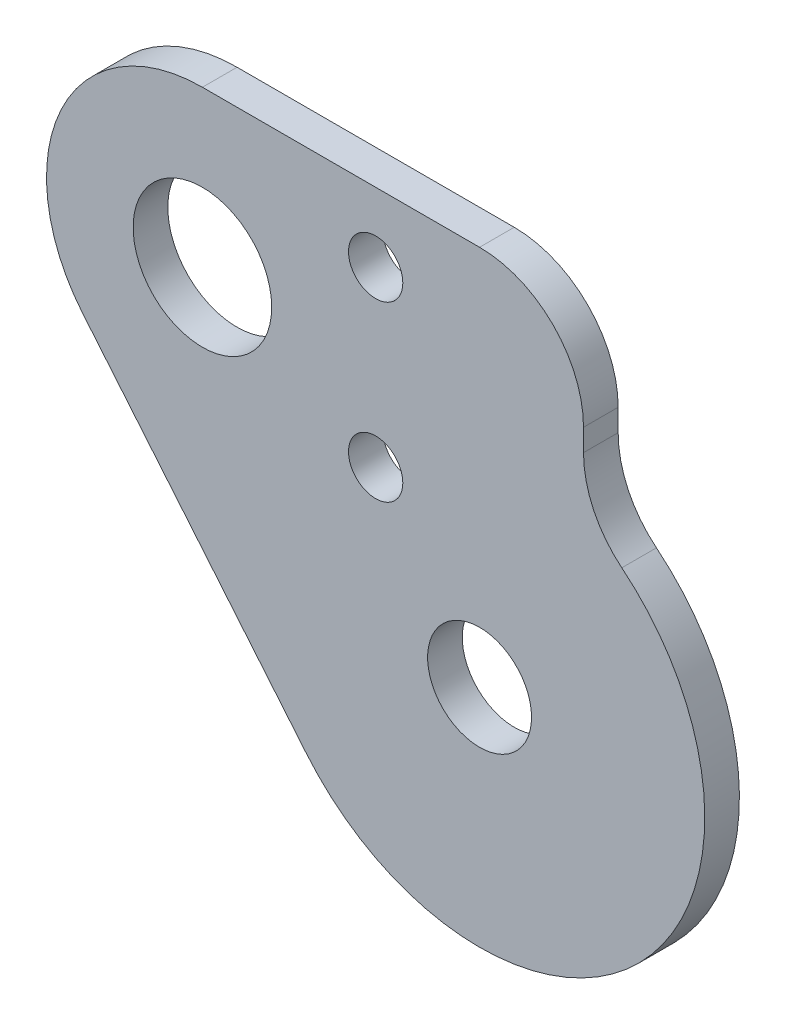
from build123d import *

# Parameters (mm, degrees)
SKETCH1_R           = 4.7625
SKETCH1_R_2         = 6.35
SKETCH1_R_3         = 2.4892
BOSS_EXTRUDE1_DEPTH = 3.175
FILLET1_R           = 9.525


with BuildPart() as part:
    # Sketch1 → Boss-Extrude1 (new body)
    with BuildSketch(Plane.XY):
        with BuildLine():
            Line((-36.389902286, 11.507620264), (-15.874303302, -13.187604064))
            ThreePointArc((-15.874303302, -13.187604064), (16.064581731, -12.955138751), (9.525, 18.307943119))
            Line((9.525, 18.307943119), (9.525, 34.925))
            Line((9.525, 34.925), (-25.4, 34.925))
            ThreePointArc((-25.4, 34.925), (-38.333982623, 26.707487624), (-36.389902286, 11.507620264))
        make_face()
        Circle(SKETCH1_R, mode=Mode.SUBTRACT)
        with Locations((-25.4, 20.6375)):
            Circle(SKETCH1_R_2, mode=Mode.SUBTRACT)
        with Locations((-9.525, 28.575)):
            Circle(SKETCH1_R_3, mode=Mode.SUBTRACT)
        with Locations((-9.525, 12.7)):
            Circle(SKETCH1_R_3, mode=Mode.SUBTRACT)
    extrude(amount=BOSS_EXTRUDE1_DEPTH)

    # Fillet1
    fillet1_edges = [part.edges().sort_by_distance(p)[0] for p in [
        (9.525, 34.925, 1.5875),
        (9.525, 18.307943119, 1.5875),
    ]]
    fillet(fillet1_edges, radius=FILLET1_R)


solid = part.part
